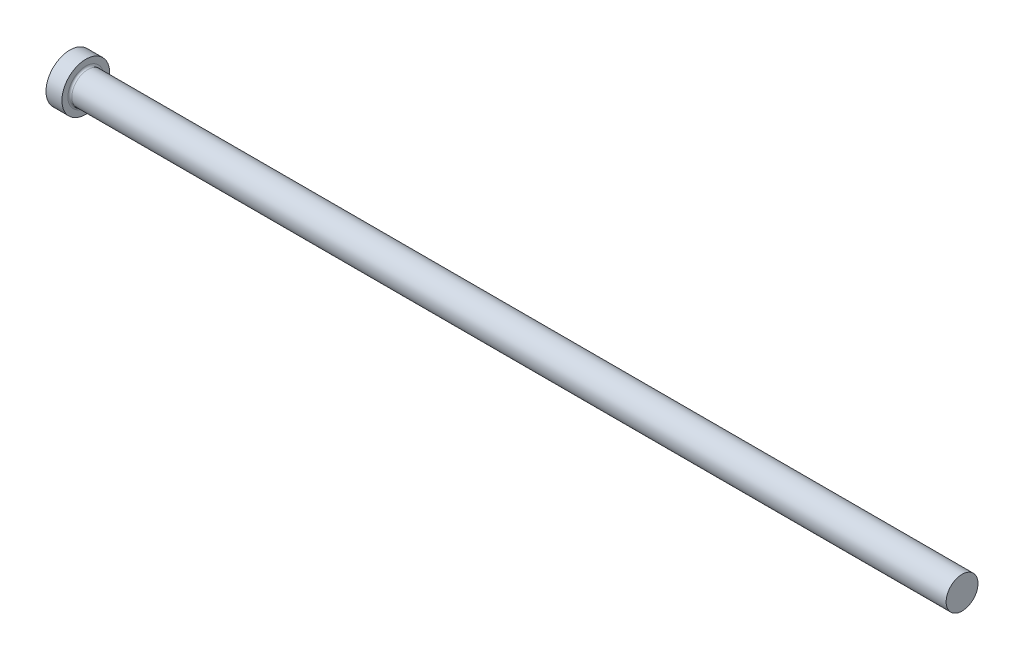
ISO-10303-21;
HEADER;
FILE_DESCRIPTION(('STEP AP214'),'2;1');
FILE_NAME('part.step','',(''),(''),'','','');
FILE_SCHEMA(('AUTOMOTIVE_DESIGN { 1 0 10303 214 1 1 1 1 }'));
ENDSEC;
DATA;
#1=APPLICATION_CONTEXT('core data for automotive mechanical design processes');
#2=APPLICATION_PROTOCOL_DEFINITION('international standard','automotive_design',2000,#1);
#3=PRODUCT_CONTEXT('',#1,'mechanical');
#4=PRODUCT('Part','Part','',(#3));
#5=PRODUCT_RELATED_PRODUCT_CATEGORY('part','',(#4));
#6=PRODUCT_DEFINITION_FORMATION('','',#4);
#7=PRODUCT_DEFINITION_CONTEXT('part definition',#1,'design');
#8=PRODUCT_DEFINITION('design','',#6,#7);
#9=PRODUCT_DEFINITION_SHAPE('','',#8);
#10=(LENGTH_UNIT() NAMED_UNIT(*) SI_UNIT(.MILLI.,.METRE.));
#11=(NAMED_UNIT(*) PLANE_ANGLE_UNIT() SI_UNIT($,.RADIAN.));
#12=(NAMED_UNIT(*) SI_UNIT($,.STERADIAN.) SOLID_ANGLE_UNIT());
#13=UNCERTAINTY_MEASURE_WITH_UNIT(LENGTH_MEASURE(1.E-05),#10,'distance_accuracy_value','');
#14=(GEOMETRIC_REPRESENTATION_CONTEXT(3) GLOBAL_UNCERTAINTY_ASSIGNED_CONTEXT((#13)) GLOBAL_UNIT_ASSIGNED_CONTEXT((#10,
#11,#12)) REPRESENTATION_CONTEXT('',''));
#15=CARTESIAN_POINT('',(0.,0.,0.));
#16=DIRECTION('',(0.,0.,1.));
#17=DIRECTION('',(1.,0.,0.));
#18=AXIS2_PLACEMENT_3D('',#15,#16,#17);
#19=CARTESIAN_POINT('',(0.,0.,0.));
#20=DIRECTION('',(1.,0.,0.));
#21=DIRECTION('',(0.,1.,0.));
#22=AXIS2_PLACEMENT_3D('',#19,#20,#21);
#23=PLANE('',#22);
#24=CARTESIAN_POINT('',(0.,0.,0.));
#25=DIRECTION('',(-1.,0.,0.));
#26=DIRECTION('',(0.,-1.,0.));
#27=AXIS2_PLACEMENT_3D('',#24,#25,#26);
#28=CIRCLE('',#27,9.52499999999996);
#29=CARTESIAN_POINT('',(0.,-9.52499999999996,0.));
#30=VERTEX_POINT('',#29);
#31=EDGE_CURVE('E10',#30,#30,#28,.T.);
#32=ORIENTED_EDGE('',*,*,#31,.T.);
#33=EDGE_LOOP('',(#32));
#34=FACE_BOUND('',#33,.T.);
#35=ADVANCED_FACE('F28',(#34),#23,.F.);
#36=CARTESIAN_POINT('',(355.6,0.,0.));
#37=DIRECTION('',(-1.,0.,0.));
#38=DIRECTION('',(0.,-1.,0.));
#39=AXIS2_PLACEMENT_3D('',#36,#37,#38);
#40=CYLINDRICAL_SURFACE('',#39,9.52499999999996);
#41=ORIENTED_EDGE('',*,*,#31,.F.);
#42=EDGE_LOOP('',(#41));
#43=FACE_BOUND('',#42,.T.);
#44=CARTESIAN_POINT('',(6.35000000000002,0.,0.));
#45=DIRECTION('',(-1.,0.,0.));
#46=DIRECTION('',(0.,-1.,0.));
#47=AXIS2_PLACEMENT_3D('',#44,#45,#46);
#48=CIRCLE('',#47,9.52499999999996);
#49=CARTESIAN_POINT('',(6.35000000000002,-9.52499999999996,0.));
#50=VERTEX_POINT('',#49);
#51=EDGE_CURVE('E34',#50,#50,#48,.T.);
#52=ORIENTED_EDGE('',*,*,#51,.T.);
#53=EDGE_LOOP('',(#52));
#54=FACE_BOUND('',#53,.T.);
#55=ADVANCED_FACE('F63',(#43,#54),#40,.T.);
#56=CARTESIAN_POINT('',(6.35,9.52499999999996,0.));
#57=DIRECTION('',(-1.,0.,0.));
#58=DIRECTION('',(0.,-1.,0.));
#59=AXIS2_PLACEMENT_3D('',#56,#57,#58);
#60=PLANE('',#59);
#61=ORIENTED_EDGE('',*,*,#51,.F.);
#62=EDGE_LOOP('',(#61));
#63=FACE_BOUND('',#62,.T.);
#64=CARTESIAN_POINT('',(6.35000000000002,0.,0.));
#65=DIRECTION('',(-1.,0.,0.));
#66=DIRECTION('',(0.,-1.,0.));
#67=AXIS2_PLACEMENT_3D('',#64,#65,#66);
#68=CIRCLE('',#67,7.1374);
#69=CARTESIAN_POINT('',(6.35000000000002,-7.1374,0.));
#70=VERTEX_POINT('',#69);
#71=EDGE_CURVE('E38',#70,#70,#68,.T.);
#72=ORIENTED_EDGE('',*,*,#71,.T.);
#73=EDGE_LOOP('',(#72));
#74=FACE_BOUND('',#73,.T.);
#75=ADVANCED_FACE('F67',(#63,#74),#60,.F.);
#76=CARTESIAN_POINT('',(7.1374,0.,0.));
#77=DIRECTION('',(-1.,0.,0.));
#78=DIRECTION('',(0.,-1.,0.));
#79=AXIS2_PLACEMENT_3D('',#76,#77,#78);
#80=TOROIDAL_SURFACE('',#79,7.1374,0.787399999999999);
#81=ORIENTED_EDGE('',*,*,#71,.F.);
#82=EDGE_LOOP('',(#81));
#83=FACE_BOUND('',#82,.T.);
#84=CARTESIAN_POINT('',(7.13740000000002,0.,0.));
#85=DIRECTION('',(-1.,0.,0.));
#86=DIRECTION('',(0.,-1.,0.));
#87=AXIS2_PLACEMENT_3D('',#84,#85,#86);
#88=CIRCLE('',#87,6.35);
#89=CARTESIAN_POINT('',(7.13740000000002,-6.35,0.));
#90=VERTEX_POINT('',#89);
#91=EDGE_CURVE('E42',#90,#90,#88,.T.);
#92=ORIENTED_EDGE('',*,*,#91,.T.);
#93=EDGE_LOOP('',(#92));
#94=FACE_BOUND('',#93,.T.);
#95=ADVANCED_FACE('F59',(#83,#94),#80,.F.);
#96=CARTESIAN_POINT('',(355.6,0.,0.));
#97=DIRECTION('',(-1.,0.,0.));
#98=DIRECTION('',(0.,-1.,0.));
#99=AXIS2_PLACEMENT_3D('',#96,#97,#98);
#100=CYLINDRICAL_SURFACE('',#99,6.34999999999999);
#101=ORIENTED_EDGE('',*,*,#91,.F.);
#102=EDGE_LOOP('',(#101));
#103=FACE_BOUND('',#102,.T.);
#104=CARTESIAN_POINT('',(355.6,0.,0.));
#105=DIRECTION('',(-1.,0.,0.));
#106=DIRECTION('',(0.,-1.,0.));
#107=AXIS2_PLACEMENT_3D('',#104,#105,#106);
#108=CIRCLE('',#107,6.34999999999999);
#109=CARTESIAN_POINT('',(355.6,-6.34999999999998,0.));
#110=VERTEX_POINT('',#109);
#111=EDGE_CURVE('E47',#110,#110,#108,.T.);
#112=ORIENTED_EDGE('',*,*,#111,.T.);
#113=EDGE_LOOP('',(#112));
#114=FACE_BOUND('',#113,.T.);
#115=ADVANCED_FACE('F51',(#103,#114),#100,.T.);
#116=CARTESIAN_POINT('',(355.6,6.35,0.));
#117=DIRECTION('',(-1.,0.,0.));
#118=DIRECTION('',(0.,-1.,0.));
#119=AXIS2_PLACEMENT_3D('',#116,#117,#118);
#120=PLANE('',#119);
#121=ORIENTED_EDGE('',*,*,#111,.F.);
#122=EDGE_LOOP('',(#121));
#123=FACE_BOUND('',#122,.T.);
#124=ADVANCED_FACE('F53',(#123),#120,.F.);
#125=CLOSED_SHELL('',(#35,#55,#75,#95,#115,#124));
#126=MANIFOLD_SOLID_BREP('B2',#125);
#127=ADVANCED_BREP_SHAPE_REPRESENTATION('',(#18,#126),#14);
#128=SHAPE_DEFINITION_REPRESENTATION(#9,#127);
ENDSEC;
END-ISO-10303-21;
